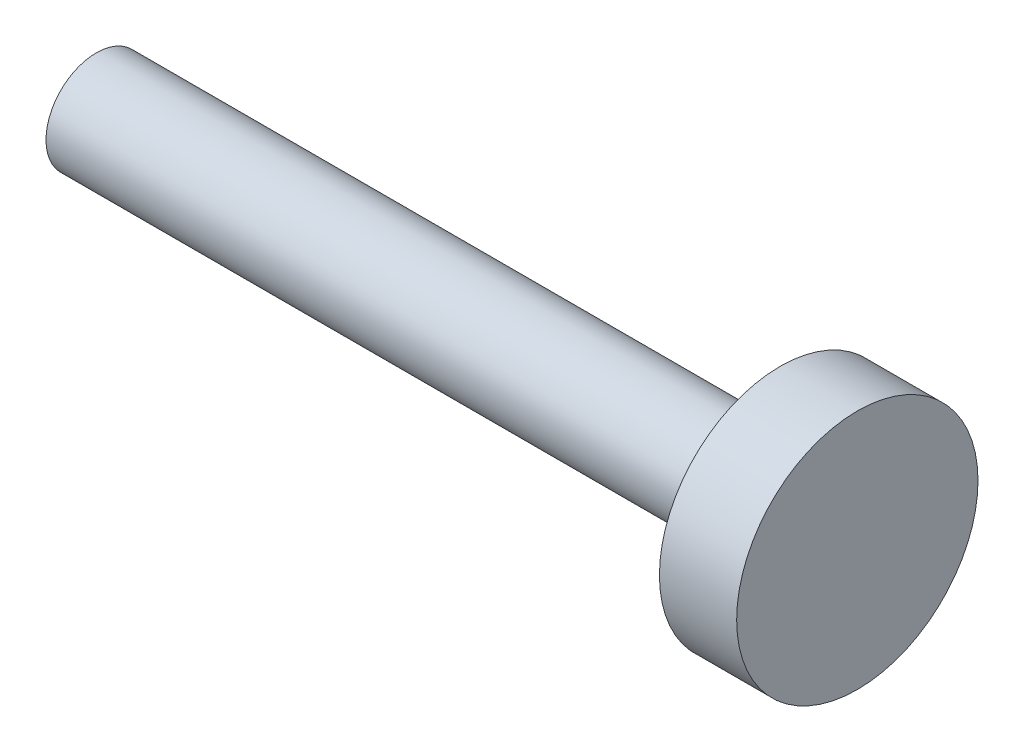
from build123d import *


with BuildPart() as part:
    # Sketch1 → Revolve1 (revolve)
    with BuildSketch(Plane.XY, mode=Mode.PRIVATE) as revolve1_sk:
        Polygon((0, 0), (0, 1.5875), (21.59, 1.5875), (21.59, 3.81), (24.0284, 3.81), (24.0284, 0), align=None)
    revolve(revolve1_sk.sketch.rotate(Axis((24.0284, 0, 0), (-1, 0, 0)), 270), axis=Axis((24.0284, 0, 0), (-1, 0, 0)))


solid = part.part
